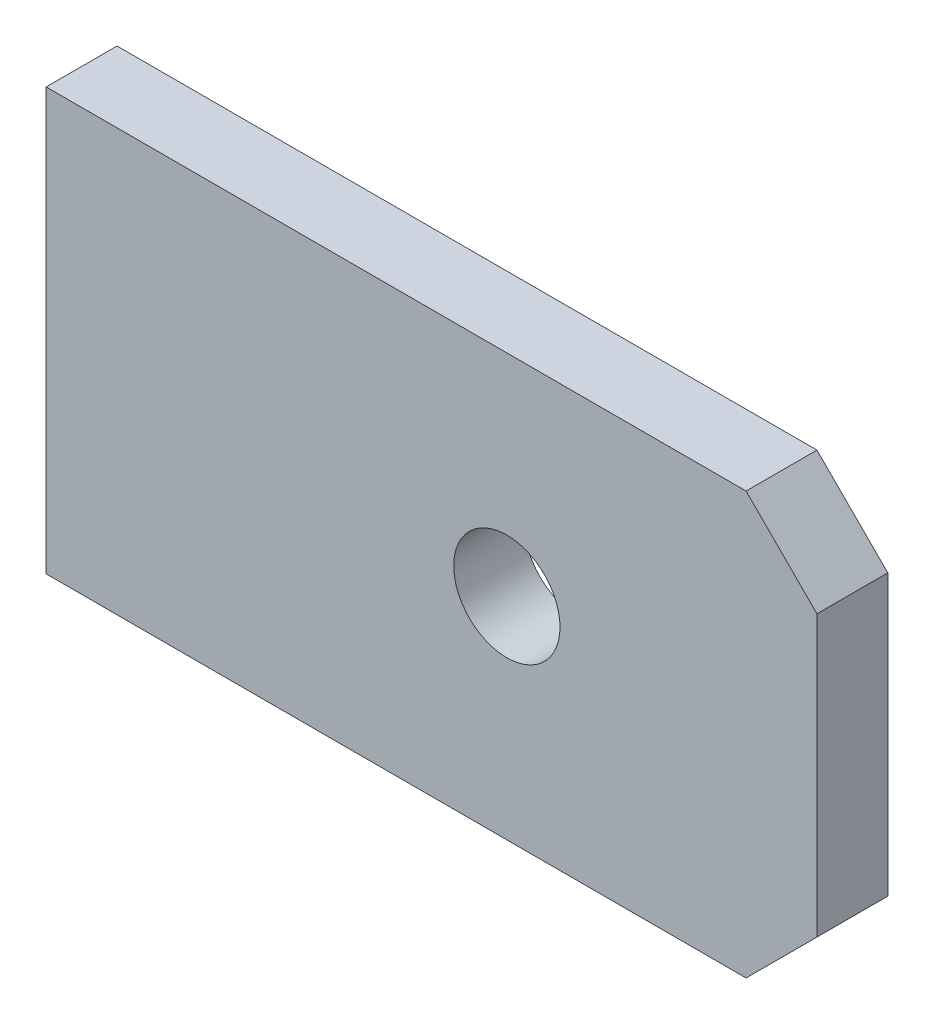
ISO-10303-21;
HEADER;
FILE_DESCRIPTION(('STEP AP214'),'2;1');
FILE_NAME('part.step','',(''),(''),'','','');
FILE_SCHEMA(('AUTOMOTIVE_DESIGN { 1 0 10303 214 1 1 1 1 }'));
ENDSEC;
DATA;
#1=APPLICATION_CONTEXT('core data for automotive mechanical design processes');
#2=APPLICATION_PROTOCOL_DEFINITION('international standard','automotive_design',2000,#1);
#3=PRODUCT_CONTEXT('',#1,'mechanical');
#4=PRODUCT('Part','Part','',(#3));
#5=PRODUCT_RELATED_PRODUCT_CATEGORY('part','',(#4));
#6=PRODUCT_DEFINITION_FORMATION('','',#4);
#7=PRODUCT_DEFINITION_CONTEXT('part definition',#1,'design');
#8=PRODUCT_DEFINITION('design','',#6,#7);
#9=PRODUCT_DEFINITION_SHAPE('','',#8);
#10=(LENGTH_UNIT() NAMED_UNIT(*) SI_UNIT(.MILLI.,.METRE.));
#11=(NAMED_UNIT(*) PLANE_ANGLE_UNIT() SI_UNIT($,.RADIAN.));
#12=(NAMED_UNIT(*) SI_UNIT($,.STERADIAN.) SOLID_ANGLE_UNIT());
#13=UNCERTAINTY_MEASURE_WITH_UNIT(LENGTH_MEASURE(1.E-05),#10,'distance_accuracy_value','');
#14=(GEOMETRIC_REPRESENTATION_CONTEXT(3) GLOBAL_UNCERTAINTY_ASSIGNED_CONTEXT((#13)) GLOBAL_UNIT_ASSIGNED_CONTEXT((#10,
#11,#12)) REPRESENTATION_CONTEXT('',''));
#15=CARTESIAN_POINT('',(0.,0.,0.));
#16=DIRECTION('',(0.,0.,1.));
#17=DIRECTION('',(1.,0.,0.));
#18=AXIS2_PLACEMENT_3D('',#15,#16,#17);
#19=CARTESIAN_POINT('',(13.1730920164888,9.57804210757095,0.));
#20=DIRECTION('',(0.,0.,1.));
#21=DIRECTION('',(1.,0.,0.));
#22=AXIS2_PLACEMENT_3D('',#19,#20,#21);
#23=PLANE('',#22);
#24=CARTESIAN_POINT('',(14.1902094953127,9.57804210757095,0.));
#25=DIRECTION('',(0.,0.,1.));
#26=DIRECTION('',(1.,0.,0.));
#27=AXIS2_PLACEMENT_3D('',#24,#25,#26);
#28=CIRCLE('',#27,0.6);
#29=CARTESIAN_POINT('',(14.7902094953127,9.57804210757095,0.));
#30=VERTEX_POINT('',#29);
#31=EDGE_CURVE('E20',#30,#30,#28,.T.);
#32=ORIENTED_EDGE('',*,*,#31,.T.);
#33=EDGE_LOOP('',(#32));
#34=FACE_BOUND('',#33,.T.);
#35=DIRECTION('',(-0.707106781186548,0.707106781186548,0.));
#36=VECTOR('',#35,1.);
#37=CARTESIAN_POINT('',(16.8902094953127,11.9580421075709,0.));
#38=LINE('',#37,#36);
#39=CARTESIAN_POINT('',(17.6902094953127,11.1580421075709,0.));
#40=VERTEX_POINT('',#39);
#41=CARTESIAN_POINT('',(16.8902094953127,11.9580421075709,0.));
#42=VERTEX_POINT('',#41);
#43=EDGE_CURVE('E71',#40,#42,#38,.T.);
#44=ORIENTED_EDGE('',*,*,#43,.F.);
#45=DIRECTION('',(0.,1.,0.));
#46=VECTOR('',#45,1.);
#47=CARTESIAN_POINT('',(17.6902094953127,11.1580421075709,0.));
#48=LINE('',#47,#46);
#49=CARTESIAN_POINT('',(17.6902094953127,7.99804210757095,0.));
#50=VERTEX_POINT('',#49);
#51=EDGE_CURVE('E105',#50,#40,#48,.T.);
#52=ORIENTED_EDGE('',*,*,#51,.F.);
#53=DIRECTION('',(0.707106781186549,0.707106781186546,0.));
#54=VECTOR('',#53,1.);
#55=CARTESIAN_POINT('',(17.6902094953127,7.99804210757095,0.));
#56=LINE('',#55,#54);
#57=CARTESIAN_POINT('',(16.8902094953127,7.19804210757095,0.));
#58=VERTEX_POINT('',#57);
#59=EDGE_CURVE('E102',#58,#50,#56,.T.);
#60=ORIENTED_EDGE('',*,*,#59,.F.);
#61=DIRECTION('',(1.,0.,0.));
#62=VECTOR('',#61,1.);
#63=CARTESIAN_POINT('',(16.8902094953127,7.19804210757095,0.));
#64=LINE('',#63,#62);
#65=CARTESIAN_POINT('',(8.99020949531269,7.19804210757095,0.));
#66=VERTEX_POINT('',#65);
#67=EDGE_CURVE('E97',#66,#58,#64,.T.);
#68=ORIENTED_EDGE('',*,*,#67,.F.);
#69=DIRECTION('',(0.,1.,0.));
#70=VECTOR('',#69,1.);
#71=CARTESIAN_POINT('',(8.99020949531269,7.19804210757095,0.));
#72=LINE('',#71,#70);
#73=CARTESIAN_POINT('',(8.99020949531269,11.9580421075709,0.));
#74=VERTEX_POINT('',#73);
#75=EDGE_CURVE('E82',#74,#66,#72,.F.);
#76=ORIENTED_EDGE('',*,*,#75,.F.);
#77=DIRECTION('',(1.,0.,0.));
#78=VECTOR('',#77,1.);
#79=CARTESIAN_POINT('',(8.99020949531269,11.9580421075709,0.));
#80=LINE('',#79,#78);
#81=EDGE_CURVE('E66',#42,#74,#80,.F.);
#82=ORIENTED_EDGE('',*,*,#81,.F.);
#83=EDGE_LOOP('',(#44,#52,#60,#68,#76,#82));
#84=FACE_BOUND('',#83,.T.);
#85=ADVANCED_FACE('F17',(#34,#84),#23,.F.);
#86=CARTESIAN_POINT('',(16.8902094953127,11.9580421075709,0.));
#87=DIRECTION('',(0.707106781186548,0.707106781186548,0.));
#88=DIRECTION('',(-0.707106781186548,0.707106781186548,0.));
#89=AXIS2_PLACEMENT_3D('',#86,#87,#88);
#90=PLANE('',#89);
#91=ORIENTED_EDGE('',*,*,#43,.T.);
#92=DIRECTION('',(0.,0.,1.));
#93=VECTOR('',#92,1.);
#94=CARTESIAN_POINT('',(16.8902094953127,11.9580421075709,0.));
#95=LINE('',#94,#93);
#96=CARTESIAN_POINT('',(16.8902094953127,11.9580421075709,0.8));
#97=VERTEX_POINT('',#96);
#98=EDGE_CURVE('E73',#97,#42,#95,.F.);
#99=ORIENTED_EDGE('',*,*,#98,.F.);
#100=DIRECTION('',(-0.707106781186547,0.707106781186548,0.));
#101=VECTOR('',#100,1.);
#102=CARTESIAN_POINT('',(17.6902094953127,11.1580421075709,0.8));
#103=LINE('',#102,#101);
#104=CARTESIAN_POINT('',(17.6902094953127,11.1580421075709,0.8));
#105=VERTEX_POINT('',#104);
#106=EDGE_CURVE('E108',#105,#97,#103,.T.);
#107=ORIENTED_EDGE('',*,*,#106,.F.);
#108=DIRECTION('',(0.,0.,-1.));
#109=VECTOR('',#108,1.);
#110=CARTESIAN_POINT('',(17.6902094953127,11.1580421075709,0.));
#111=LINE('',#110,#109);
#112=EDGE_CURVE('E76',#40,#105,#111,.F.);
#113=ORIENTED_EDGE('',*,*,#112,.F.);
#114=EDGE_LOOP('',(#91,#99,#107,#113));
#115=FACE_BOUND('',#114,.T.);
#116=ADVANCED_FACE('F72',(#115),#90,.T.);
#117=CARTESIAN_POINT('',(8.99020949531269,11.9580421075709,0.));
#118=DIRECTION('',(0.,1.,0.));
#119=DIRECTION('',(0.,0.,1.));
#120=AXIS2_PLACEMENT_3D('',#117,#118,#119);
#121=PLANE('',#120);
#122=ORIENTED_EDGE('',*,*,#81,.T.);
#123=DIRECTION('',(0.,0.,1.));
#124=VECTOR('',#123,1.);
#125=CARTESIAN_POINT('',(8.99020949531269,11.9580421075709,0.));
#126=LINE('',#125,#124);
#127=CARTESIAN_POINT('',(8.99020949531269,11.9580421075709,0.8));
#128=VERTEX_POINT('',#127);
#129=EDGE_CURVE('E84',#128,#74,#126,.F.);
#130=ORIENTED_EDGE('',*,*,#129,.F.);
#131=DIRECTION('',(1.,0.,0.));
#132=VECTOR('',#131,1.);
#133=CARTESIAN_POINT('',(13.1730920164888,11.9580421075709,0.8));
#134=LINE('',#133,#132);
#135=EDGE_CURVE('E88',#97,#128,#134,.F.);
#136=ORIENTED_EDGE('',*,*,#135,.F.);
#137=ORIENTED_EDGE('',*,*,#98,.T.);
#138=EDGE_LOOP('',(#122,#130,#136,#137));
#139=FACE_BOUND('',#138,.T.);
#140=ADVANCED_FACE('F86',(#139),#121,.T.);
#141=CARTESIAN_POINT('',(8.99020949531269,7.19804210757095,0.));
#142=DIRECTION('',(-1.,0.,0.));
#143=DIRECTION('',(0.,0.,1.));
#144=AXIS2_PLACEMENT_3D('',#141,#142,#143);
#145=PLANE('',#144);
#146=ORIENTED_EDGE('',*,*,#75,.T.);
#147=DIRECTION('',(0.,0.,-1.));
#148=VECTOR('',#147,1.);
#149=CARTESIAN_POINT('',(8.99020949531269,7.19804210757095,0.));
#150=LINE('',#149,#148);
#151=CARTESIAN_POINT('',(8.99020949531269,7.19804210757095,0.8));
#152=VERTEX_POINT('',#151);
#153=EDGE_CURVE('E94',#152,#66,#150,.T.);
#154=ORIENTED_EDGE('',*,*,#153,.F.);
#155=DIRECTION('',(0.,1.,0.));
#156=VECTOR('',#155,1.);
#157=CARTESIAN_POINT('',(8.99020949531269,9.57804210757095,0.8));
#158=LINE('',#157,#156);
#159=EDGE_CURVE('E111',#128,#152,#158,.F.);
#160=ORIENTED_EDGE('',*,*,#159,.F.);
#161=ORIENTED_EDGE('',*,*,#129,.T.);
#162=EDGE_LOOP('',(#146,#154,#160,#161));
#163=FACE_BOUND('',#162,.T.);
#164=ADVANCED_FACE('F132',(#163),#145,.T.);
#165=CARTESIAN_POINT('',(16.8902094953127,7.19804210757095,0.));
#166=DIRECTION('',(0.,-1.,0.));
#167=DIRECTION('',(0.,0.,-1.));
#168=AXIS2_PLACEMENT_3D('',#165,#166,#167);
#169=PLANE('',#168);
#170=ORIENTED_EDGE('',*,*,#67,.T.);
#171=DIRECTION('',(0.,0.,1.));
#172=VECTOR('',#171,1.);
#173=CARTESIAN_POINT('',(16.8902094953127,7.19804210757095,0.));
#174=LINE('',#173,#172);
#175=CARTESIAN_POINT('',(16.8902094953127,7.19804210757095,0.8));
#176=VERTEX_POINT('',#175);
#177=EDGE_CURVE('E99',#176,#58,#174,.F.);
#178=ORIENTED_EDGE('',*,*,#177,.F.);
#179=DIRECTION('',(1.,0.,0.));
#180=VECTOR('',#179,1.);
#181=CARTESIAN_POINT('',(13.1730920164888,7.19804210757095,0.8));
#182=LINE('',#181,#180);
#183=EDGE_CURVE('E114',#152,#176,#182,.T.);
#184=ORIENTED_EDGE('',*,*,#183,.F.);
#185=ORIENTED_EDGE('',*,*,#153,.T.);
#186=EDGE_LOOP('',(#170,#178,#184,#185));
#187=FACE_BOUND('',#186,.T.);
#188=ADVANCED_FACE('F129',(#187),#169,.T.);
#189=CARTESIAN_POINT('',(17.6902094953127,7.99804210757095,0.));
#190=DIRECTION('',(0.707106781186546,-0.707106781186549,0.));
#191=DIRECTION('',(0.707106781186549,0.707106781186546,0.));
#192=AXIS2_PLACEMENT_3D('',#189,#190,#191);
#193=PLANE('',#192);
#194=ORIENTED_EDGE('',*,*,#59,.T.);
#195=DIRECTION('',(0.,0.,-1.));
#196=VECTOR('',#195,1.);
#197=CARTESIAN_POINT('',(17.6902094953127,7.99804210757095,0.));
#198=LINE('',#197,#196);
#199=CARTESIAN_POINT('',(17.6902094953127,7.99804210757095,0.8));
#200=VERTEX_POINT('',#199);
#201=EDGE_CURVE('E34',#200,#50,#198,.T.);
#202=ORIENTED_EDGE('',*,*,#201,.F.);
#203=DIRECTION('',(0.707106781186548,0.707106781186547,0.));
#204=VECTOR('',#203,1.);
#205=CARTESIAN_POINT('',(16.8902094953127,7.19804210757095,0.8));
#206=LINE('',#205,#204);
#207=EDGE_CURVE('E117',#176,#200,#206,.T.);
#208=ORIENTED_EDGE('',*,*,#207,.F.);
#209=ORIENTED_EDGE('',*,*,#177,.T.);
#210=EDGE_LOOP('',(#194,#202,#208,#209));
#211=FACE_BOUND('',#210,.T.);
#212=ADVANCED_FACE('F126',(#211),#193,.T.);
#213=CARTESIAN_POINT('',(17.6902094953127,11.1580421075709,0.));
#214=DIRECTION('',(1.,0.,0.));
#215=DIRECTION('',(0.,0.,-1.));
#216=AXIS2_PLACEMENT_3D('',#213,#214,#215);
#217=PLANE('',#216);
#218=ORIENTED_EDGE('',*,*,#51,.T.);
#219=ORIENTED_EDGE('',*,*,#112,.T.);
#220=DIRECTION('',(0.,1.,0.));
#221=VECTOR('',#220,1.);
#222=CARTESIAN_POINT('',(17.6902094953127,9.57804210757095,0.8));
#223=LINE('',#222,#221);
#224=EDGE_CURVE('E26',#200,#105,#223,.T.);
#225=ORIENTED_EDGE('',*,*,#224,.F.);
#226=ORIENTED_EDGE('',*,*,#201,.T.);
#227=EDGE_LOOP('',(#218,#219,#225,#226));
#228=FACE_BOUND('',#227,.T.);
#229=ADVANCED_FACE('F124',(#228),#217,.T.);
#230=CARTESIAN_POINT('',(14.1902094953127,9.57804210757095,0.));
#231=DIRECTION('',(0.,0.,1.));
#232=DIRECTION('',(1.,0.,0.));
#233=AXIS2_PLACEMENT_3D('',#230,#231,#232);
#234=CYLINDRICAL_SURFACE('',#233,0.6);
#235=ORIENTED_EDGE('',*,*,#31,.F.);
#236=EDGE_LOOP('',(#235));
#237=FACE_BOUND('',#236,.T.);
#238=CARTESIAN_POINT('',(14.1902094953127,9.57804210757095,0.8));
#239=DIRECTION('',(0.,0.,1.));
#240=DIRECTION('',(1.,0.,0.));
#241=AXIS2_PLACEMENT_3D('',#238,#239,#240);
#242=CIRCLE('',#241,0.6);
#243=CARTESIAN_POINT('',(14.7902094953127,9.57804210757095,0.8));
#244=VERTEX_POINT('',#243);
#245=EDGE_CURVE('E11',#244,#244,#242,.F.);
#246=ORIENTED_EDGE('',*,*,#245,.F.);
#247=EDGE_LOOP('',(#246));
#248=FACE_BOUND('',#247,.T.);
#249=ADVANCED_FACE('F143',(#237,#248),#234,.F.);
#250=CARTESIAN_POINT('',(13.1730920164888,9.57804210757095,0.8));
#251=DIRECTION('',(0.,0.,1.));
#252=DIRECTION('',(1.,0.,0.));
#253=AXIS2_PLACEMENT_3D('',#250,#251,#252);
#254=PLANE('',#253);
#255=ORIENTED_EDGE('',*,*,#245,.T.);
#256=EDGE_LOOP('',(#255));
#257=FACE_BOUND('',#256,.T.);
#258=ORIENTED_EDGE('',*,*,#207,.T.);
#259=ORIENTED_EDGE('',*,*,#224,.T.);
#260=ORIENTED_EDGE('',*,*,#106,.T.);
#261=ORIENTED_EDGE('',*,*,#135,.T.);
#262=ORIENTED_EDGE('',*,*,#159,.T.);
#263=ORIENTED_EDGE('',*,*,#183,.T.);
#264=EDGE_LOOP('',(#258,#259,#260,#261,#262,#263));
#265=FACE_BOUND('',#264,.T.);
#266=ADVANCED_FACE('F122',(#257,#265),#254,.T.);
#267=CLOSED_SHELL('',(#85,#116,#140,#164,#188,#212,#229,#249,#266));
#268=MANIFOLD_SOLID_BREP('B1',#267);
#269=ADVANCED_BREP_SHAPE_REPRESENTATION('',(#18,#268),#14);
#270=SHAPE_DEFINITION_REPRESENTATION(#9,#269);
ENDSEC;
END-ISO-10303-21;
